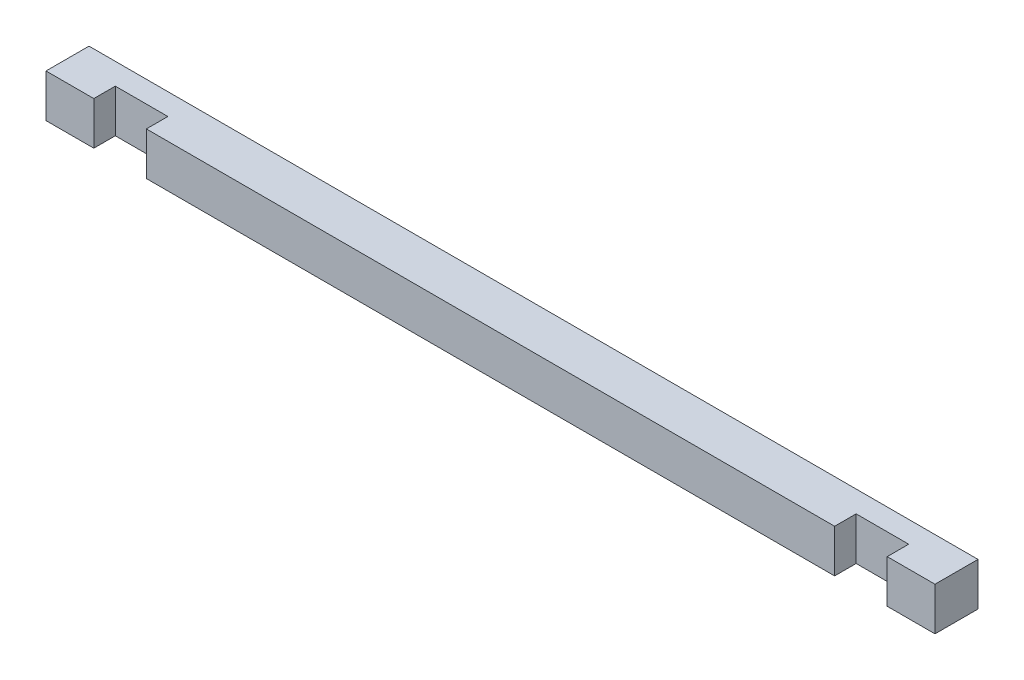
ISO-10303-21;
HEADER;
FILE_DESCRIPTION(('STEP AP214'),'2;1');
FILE_NAME('part.step','',(''),(''),'','','');
FILE_SCHEMA(('AUTOMOTIVE_DESIGN { 1 0 10303 214 1 1 1 1 }'));
ENDSEC;
DATA;
#1=APPLICATION_CONTEXT('core data for automotive mechanical design processes');
#2=APPLICATION_PROTOCOL_DEFINITION('international standard','automotive_design',2000,#1);
#3=PRODUCT_CONTEXT('',#1,'mechanical');
#4=PRODUCT('Part','Part','',(#3));
#5=PRODUCT_RELATED_PRODUCT_CATEGORY('part','',(#4));
#6=PRODUCT_DEFINITION_FORMATION('','',#4);
#7=PRODUCT_DEFINITION_CONTEXT('part definition',#1,'design');
#8=PRODUCT_DEFINITION('design','',#6,#7);
#9=PRODUCT_DEFINITION_SHAPE('','',#8);
#10=(LENGTH_UNIT() NAMED_UNIT(*) SI_UNIT(.MILLI.,.METRE.));
#11=(NAMED_UNIT(*) PLANE_ANGLE_UNIT() SI_UNIT($,.RADIAN.));
#12=(NAMED_UNIT(*) SI_UNIT($,.STERADIAN.) SOLID_ANGLE_UNIT());
#13=UNCERTAINTY_MEASURE_WITH_UNIT(LENGTH_MEASURE(1.E-05),#10,'distance_accuracy_value','');
#14=(GEOMETRIC_REPRESENTATION_CONTEXT(3) GLOBAL_UNCERTAINTY_ASSIGNED_CONTEXT((#13)) GLOBAL_UNIT_ASSIGNED_CONTEXT((#10,
#11,#12)) REPRESENTATION_CONTEXT('',''));
#15=CARTESIAN_POINT('',(0.,0.,0.));
#16=DIRECTION('',(0.,0.,1.));
#17=DIRECTION('',(1.,0.,0.));
#18=AXIS2_PLACEMENT_3D('',#15,#16,#17);
#19=CARTESIAN_POINT('',(0.,9.,9.));
#20=DIRECTION('',(0.,0.,-1.));
#21=DIRECTION('',(-1.,0.,0.));
#22=AXIS2_PLACEMENT_3D('',#19,#20,#21);
#23=PLANE('',#22);
#24=DIRECTION('',(1.,0.,0.));
#25=VECTOR('',#24,1.);
#26=CARTESIAN_POINT('',(0.,0.,9.));
#27=LINE('',#26,#25);
#28=CARTESIAN_POINT('',(0.,0.,9.));
#29=VERTEX_POINT('',#28);
#30=CARTESIAN_POINT('',(10.,0.,9.));
#31=VERTEX_POINT('',#30);
#32=EDGE_CURVE('E185',#29,#31,#27,.T.);
#33=ORIENTED_EDGE('',*,*,#32,.T.);
#34=DIRECTION('',(0.,-1.,0.));
#35=VECTOR('',#34,1.);
#36=CARTESIAN_POINT('',(10.,0.,9.));
#37=LINE('',#36,#35);
#38=CARTESIAN_POINT('',(10.,9.,9.));
#39=VERTEX_POINT('',#38);
#40=EDGE_CURVE('E125',#39,#31,#37,.T.);
#41=ORIENTED_EDGE('',*,*,#40,.F.);
#42=DIRECTION('',(-1.,0.,0.));
#43=VECTOR('',#42,1.);
#44=CARTESIAN_POINT('',(0.,9.,9.));
#45=LINE('',#44,#43);
#46=CARTESIAN_POINT('',(0.,9.,9.));
#47=VERTEX_POINT('',#46);
#48=EDGE_CURVE('E190',#39,#47,#45,.T.);
#49=ORIENTED_EDGE('',*,*,#48,.T.);
#50=DIRECTION('',(0.,-1.,0.));
#51=VECTOR('',#50,1.);
#52=CARTESIAN_POINT('',(0.,0.,9.));
#53=LINE('',#52,#51);
#54=EDGE_CURVE('E180',#47,#29,#53,.T.);
#55=ORIENTED_EDGE('',*,*,#54,.T.);
#56=EDGE_LOOP('',(#33,#41,#49,#55));
#57=FACE_BOUND('',#56,.T.);
#58=ADVANCED_FACE('F31',(#57),#23,.F.);
#59=CARTESIAN_POINT('',(165.,9.,9.));
#60=VERTEX_POINT('',#59);
#61=CARTESIAN_POINT('',(21.,9.,9.));
#62=VERTEX_POINT('',#61);
#63=EDGE_CURVE('E195',#60,#62,#45,.T.);
#64=ORIENTED_EDGE('',*,*,#63,.T.);
#65=DIRECTION('',(0.,1.,0.));
#66=VECTOR('',#65,1.);
#67=CARTESIAN_POINT('',(21.,0.,9.));
#68=LINE('',#67,#66);
#69=CARTESIAN_POINT('',(21.,0.,9.));
#70=VERTEX_POINT('',#69);
#71=EDGE_CURVE('E137',#70,#62,#68,.T.);
#72=ORIENTED_EDGE('',*,*,#71,.F.);
#73=CARTESIAN_POINT('',(165.,0.,9.));
#74=VERTEX_POINT('',#73);
#75=EDGE_CURVE('E188',#70,#74,#27,.T.);
#76=ORIENTED_EDGE('',*,*,#75,.T.);
#77=DIRECTION('',(0.,-1.,0.));
#78=VECTOR('',#77,1.);
#79=CARTESIAN_POINT('',(165.,0.,9.));
#80=LINE('',#79,#78);
#81=EDGE_CURVE('E149',#60,#74,#80,.T.);
#82=ORIENTED_EDGE('',*,*,#81,.F.);
#83=EDGE_LOOP('',(#64,#72,#76,#82));
#84=FACE_BOUND('',#83,.T.);
#85=ADVANCED_FACE('F233',(#84),#23,.F.);
#86=CARTESIAN_POINT('',(0.,0.,9.));
#87=DIRECTION('',(1.,0.,0.));
#88=DIRECTION('',(0.,0.,-1.));
#89=AXIS2_PLACEMENT_3D('',#86,#87,#88);
#90=PLANE('',#89);
#91=DIRECTION('',(0.,-1.,0.));
#92=VECTOR('',#91,1.);
#93=CARTESIAN_POINT('',(0.,0.,0.));
#94=LINE('',#93,#92);
#95=CARTESIAN_POINT('',(0.,9.,0.));
#96=VERTEX_POINT('',#95);
#97=CARTESIAN_POINT('',(0.,0.,0.));
#98=VERTEX_POINT('',#97);
#99=EDGE_CURVE('E173',#96,#98,#94,.T.);
#100=ORIENTED_EDGE('',*,*,#99,.T.);
#101=DIRECTION('',(0.,0.,-1.));
#102=VECTOR('',#101,1.);
#103=CARTESIAN_POINT('',(0.,0.,9.));
#104=LINE('',#103,#102);
#105=EDGE_CURVE('E11',#29,#98,#104,.T.);
#106=ORIENTED_EDGE('',*,*,#105,.F.);
#107=ORIENTED_EDGE('',*,*,#54,.F.);
#108=DIRECTION('',(0.,0.,-1.));
#109=VECTOR('',#108,1.);
#110=CARTESIAN_POINT('',(0.,9.,9.));
#111=LINE('',#110,#109);
#112=EDGE_CURVE('E194',#47,#96,#111,.T.);
#113=ORIENTED_EDGE('',*,*,#112,.T.);
#114=EDGE_LOOP('',(#100,#106,#107,#113));
#115=FACE_BOUND('',#114,.T.);
#116=ADVANCED_FACE('F33',(#115),#90,.F.);
#117=CARTESIAN_POINT('',(0.,0.,9.));
#118=DIRECTION('',(0.,1.,0.));
#119=DIRECTION('',(0.,0.,1.));
#120=AXIS2_PLACEMENT_3D('',#117,#118,#119);
#121=PLANE('',#120);
#122=DIRECTION('',(1.,0.,0.));
#123=VECTOR('',#122,1.);
#124=CARTESIAN_POINT('',(10.,0.,4.5));
#125=LINE('',#124,#123);
#126=CARTESIAN_POINT('',(10.,0.,4.5));
#127=VERTEX_POINT('',#126);
#128=CARTESIAN_POINT('',(21.,0.,4.5));
#129=VERTEX_POINT('',#128);
#130=EDGE_CURVE('E133',#127,#129,#125,.T.);
#131=ORIENTED_EDGE('',*,*,#130,.F.);
#132=DIRECTION('',(0.,0.,1.));
#133=VECTOR('',#132,1.);
#134=CARTESIAN_POINT('',(10.,0.,4.5));
#135=LINE('',#134,#133);
#136=EDGE_CURVE('E120',#127,#31,#135,.T.);
#137=ORIENTED_EDGE('',*,*,#136,.T.);
#138=ORIENTED_EDGE('',*,*,#32,.F.);
#139=ORIENTED_EDGE('',*,*,#105,.T.);
#140=DIRECTION('',(1.,0.,0.));
#141=VECTOR('',#140,1.);
#142=CARTESIAN_POINT('',(0.,0.,0.));
#143=LINE('',#142,#141);
#144=CARTESIAN_POINT('',(186.,0.,0.));
#145=VERTEX_POINT('',#144);
#146=EDGE_CURVE('E198',#98,#145,#143,.T.);
#147=ORIENTED_EDGE('',*,*,#146,.T.);
#148=DIRECTION('',(0.,0.,-1.));
#149=VECTOR('',#148,1.);
#150=CARTESIAN_POINT('',(186.,0.,9.));
#151=LINE('',#150,#149);
#152=CARTESIAN_POINT('',(186.,0.,9.));
#153=VERTEX_POINT('',#152);
#154=EDGE_CURVE('E39',#153,#145,#151,.T.);
#155=ORIENTED_EDGE('',*,*,#154,.F.);
#156=CARTESIAN_POINT('',(176.,0.,9.));
#157=VERTEX_POINT('',#156);
#158=EDGE_CURVE('E183',#157,#153,#27,.T.);
#159=ORIENTED_EDGE('',*,*,#158,.F.);
#160=DIRECTION('',(0.,0.,1.));
#161=VECTOR('',#160,1.);
#162=CARTESIAN_POINT('',(176.,0.,4.5));
#163=LINE('',#162,#161);
#164=CARTESIAN_POINT('',(176.,0.,4.5));
#165=VERTEX_POINT('',#164);
#166=EDGE_CURVE('E54',#165,#157,#163,.T.);
#167=ORIENTED_EDGE('',*,*,#166,.F.);
#168=DIRECTION('',(1.,0.,0.));
#169=VECTOR('',#168,1.);
#170=CARTESIAN_POINT('',(165.,0.,4.5));
#171=LINE('',#170,#169);
#172=CARTESIAN_POINT('',(165.,0.,4.5));
#173=VERTEX_POINT('',#172);
#174=EDGE_CURVE('E157',#173,#165,#171,.T.);
#175=ORIENTED_EDGE('',*,*,#174,.F.);
#176=DIRECTION('',(0.,0.,1.));
#177=VECTOR('',#176,1.);
#178=CARTESIAN_POINT('',(165.,0.,4.5));
#179=LINE('',#178,#177);
#180=EDGE_CURVE('E167',#173,#74,#179,.T.);
#181=ORIENTED_EDGE('',*,*,#180,.T.);
#182=ORIENTED_EDGE('',*,*,#75,.F.);
#183=DIRECTION('',(0.,0.,1.));
#184=VECTOR('',#183,1.);
#185=CARTESIAN_POINT('',(21.,0.,4.5));
#186=LINE('',#185,#184);
#187=EDGE_CURVE('E129',#129,#70,#186,.T.);
#188=ORIENTED_EDGE('',*,*,#187,.F.);
#189=EDGE_LOOP('',(#131,#137,#138,#139,#147,#155,#159,#167,#175,#181,#182,#188));
#190=FACE_BOUND('',#189,.T.);
#191=ADVANCED_FACE('F139',(#190),#121,.F.);
#192=CARTESIAN_POINT('',(186.,0.,9.));
#193=DIRECTION('',(-1.,0.,0.));
#194=DIRECTION('',(0.,0.,1.));
#195=AXIS2_PLACEMENT_3D('',#192,#193,#194);
#196=PLANE('',#195);
#197=DIRECTION('',(0.,1.,0.));
#198=VECTOR('',#197,1.);
#199=CARTESIAN_POINT('',(186.,0.,0.));
#200=LINE('',#199,#198);
#201=CARTESIAN_POINT('',(186.,9.,0.));
#202=VERTEX_POINT('',#201);
#203=EDGE_CURVE('E200',#145,#202,#200,.T.);
#204=ORIENTED_EDGE('',*,*,#203,.T.);
#205=DIRECTION('',(0.,0.,-1.));
#206=VECTOR('',#205,1.);
#207=CARTESIAN_POINT('',(186.,9.,9.));
#208=LINE('',#207,#206);
#209=CARTESIAN_POINT('',(186.,9.,9.));
#210=VERTEX_POINT('',#209);
#211=EDGE_CURVE('E205',#210,#202,#208,.T.);
#212=ORIENTED_EDGE('',*,*,#211,.F.);
#213=DIRECTION('',(0.,1.,0.));
#214=VECTOR('',#213,1.);
#215=CARTESIAN_POINT('',(186.,0.,9.));
#216=LINE('',#215,#214);
#217=EDGE_CURVE('E187',#153,#210,#216,.T.);
#218=ORIENTED_EDGE('',*,*,#217,.F.);
#219=ORIENTED_EDGE('',*,*,#154,.T.);
#220=EDGE_LOOP('',(#204,#212,#218,#219));
#221=FACE_BOUND('',#220,.T.);
#222=ADVANCED_FACE('F212',(#221),#196,.F.);
#223=CARTESIAN_POINT('',(0.,9.,9.));
#224=DIRECTION('',(0.,-1.,0.));
#225=DIRECTION('',(0.,0.,-1.));
#226=AXIS2_PLACEMENT_3D('',#223,#224,#225);
#227=PLANE('',#226);
#228=ORIENTED_EDGE('',*,*,#48,.F.);
#229=DIRECTION('',(0.,0.,1.));
#230=VECTOR('',#229,1.);
#231=CARTESIAN_POINT('',(10.,9.,4.5));
#232=LINE('',#231,#230);
#233=CARTESIAN_POINT('',(10.,9.,4.5));
#234=VERTEX_POINT('',#233);
#235=EDGE_CURVE('E147',#234,#39,#232,.T.);
#236=ORIENTED_EDGE('',*,*,#235,.F.);
#237=DIRECTION('',(-1.,0.,0.));
#238=VECTOR('',#237,1.);
#239=CARTESIAN_POINT('',(10.,9.,4.5));
#240=LINE('',#239,#238);
#241=CARTESIAN_POINT('',(21.,9.,4.5));
#242=VERTEX_POINT('',#241);
#243=EDGE_CURVE('E130',#242,#234,#240,.T.);
#244=ORIENTED_EDGE('',*,*,#243,.F.);
#245=DIRECTION('',(0.,0.,1.));
#246=VECTOR('',#245,1.);
#247=CARTESIAN_POINT('',(21.,9.,4.5));
#248=LINE('',#247,#246);
#249=EDGE_CURVE('E150',#242,#62,#248,.T.);
#250=ORIENTED_EDGE('',*,*,#249,.T.);
#251=ORIENTED_EDGE('',*,*,#63,.F.);
#252=DIRECTION('',(0.,0.,1.));
#253=VECTOR('',#252,1.);
#254=CARTESIAN_POINT('',(165.,9.,4.5));
#255=LINE('',#254,#253);
#256=CARTESIAN_POINT('',(165.,9.,4.5));
#257=VERTEX_POINT('',#256);
#258=EDGE_CURVE('E171',#257,#60,#255,.T.);
#259=ORIENTED_EDGE('',*,*,#258,.F.);
#260=DIRECTION('',(-1.,0.,0.));
#261=VECTOR('',#260,1.);
#262=CARTESIAN_POINT('',(165.,9.,4.5));
#263=LINE('',#262,#261);
#264=CARTESIAN_POINT('',(176.,9.,4.5));
#265=VERTEX_POINT('',#264);
#266=EDGE_CURVE('E164',#265,#257,#263,.T.);
#267=ORIENTED_EDGE('',*,*,#266,.F.);
#268=DIRECTION('',(0.,0.,1.));
#269=VECTOR('',#268,1.);
#270=CARTESIAN_POINT('',(176.,9.,4.5));
#271=LINE('',#270,#269);
#272=CARTESIAN_POINT('',(176.,9.,9.));
#273=VERTEX_POINT('',#272);
#274=EDGE_CURVE('E174',#265,#273,#271,.T.);
#275=ORIENTED_EDGE('',*,*,#274,.T.);
#276=EDGE_CURVE('E191',#210,#273,#45,.T.);
#277=ORIENTED_EDGE('',*,*,#276,.F.);
#278=ORIENTED_EDGE('',*,*,#211,.T.);
#279=DIRECTION('',(-1.,0.,0.));
#280=VECTOR('',#279,1.);
#281=CARTESIAN_POINT('',(0.,9.,0.));
#282=LINE('',#281,#280);
#283=EDGE_CURVE('E184',#202,#96,#282,.T.);
#284=ORIENTED_EDGE('',*,*,#283,.T.);
#285=ORIENTED_EDGE('',*,*,#112,.F.);
#286=EDGE_LOOP('',(#228,#236,#244,#250,#251,#259,#267,#275,#277,#278,#284,#285));
#287=FACE_BOUND('',#286,.T.);
#288=ADVANCED_FACE('F222',(#287),#227,.F.);
#289=ORIENTED_EDGE('',*,*,#276,.T.);
#290=DIRECTION('',(0.,1.,0.));
#291=VECTOR('',#290,1.);
#292=CARTESIAN_POINT('',(176.,0.,9.));
#293=LINE('',#292,#291);
#294=EDGE_CURVE('E158',#157,#273,#293,.T.);
#295=ORIENTED_EDGE('',*,*,#294,.F.);
#296=ORIENTED_EDGE('',*,*,#158,.T.);
#297=ORIENTED_EDGE('',*,*,#217,.T.);
#298=EDGE_LOOP('',(#289,#295,#296,#297));
#299=FACE_BOUND('',#298,.T.);
#300=ADVANCED_FACE('F249',(#299),#23,.F.);
#301=CARTESIAN_POINT('',(0.,9.,0.));
#302=DIRECTION('',(0.,0.,-1.));
#303=DIRECTION('',(-1.,0.,0.));
#304=AXIS2_PLACEMENT_3D('',#301,#302,#303);
#305=PLANE('',#304);
#306=ORIENTED_EDGE('',*,*,#99,.F.);
#307=ORIENTED_EDGE('',*,*,#283,.F.);
#308=ORIENTED_EDGE('',*,*,#203,.F.);
#309=ORIENTED_EDGE('',*,*,#146,.F.);
#310=EDGE_LOOP('',(#306,#307,#308,#309));
#311=FACE_BOUND('',#310,.T.);
#312=ADVANCED_FACE('F218',(#311),#305,.T.);
#313=CARTESIAN_POINT('',(165.,0.,4.5));
#314=DIRECTION('',(-1.,0.,0.));
#315=DIRECTION('',(0.,0.,1.));
#316=AXIS2_PLACEMENT_3D('',#313,#314,#315);
#317=PLANE('',#316);
#318=ORIENTED_EDGE('',*,*,#81,.T.);
#319=ORIENTED_EDGE('',*,*,#180,.F.);
#320=DIRECTION('',(0.,-1.,0.));
#321=VECTOR('',#320,1.);
#322=CARTESIAN_POINT('',(165.,0.,4.5));
#323=LINE('',#322,#321);
#324=EDGE_CURVE('E154',#257,#173,#323,.T.);
#325=ORIENTED_EDGE('',*,*,#324,.F.);
#326=ORIENTED_EDGE('',*,*,#258,.T.);
#327=EDGE_LOOP('',(#318,#319,#325,#326));
#328=FACE_BOUND('',#327,.T.);
#329=ADVANCED_FACE('F261',(#328),#317,.F.);
#330=CARTESIAN_POINT('',(176.,0.,4.5));
#331=DIRECTION('',(1.,0.,0.));
#332=DIRECTION('',(0.,0.,-1.));
#333=AXIS2_PLACEMENT_3D('',#330,#331,#332);
#334=PLANE('',#333);
#335=ORIENTED_EDGE('',*,*,#294,.T.);
#336=ORIENTED_EDGE('',*,*,#274,.F.);
#337=DIRECTION('',(0.,1.,0.));
#338=VECTOR('',#337,1.);
#339=CARTESIAN_POINT('',(176.,0.,4.5));
#340=LINE('',#339,#338);
#341=EDGE_CURVE('E161',#165,#265,#340,.T.);
#342=ORIENTED_EDGE('',*,*,#341,.F.);
#343=ORIENTED_EDGE('',*,*,#166,.T.);
#344=EDGE_LOOP('',(#335,#336,#342,#343));
#345=FACE_BOUND('',#344,.T.);
#346=ADVANCED_FACE('F263',(#345),#334,.F.);
#347=CARTESIAN_POINT('',(165.,9.,4.5));
#348=DIRECTION('',(0.,0.,-1.));
#349=DIRECTION('',(-1.,0.,0.));
#350=AXIS2_PLACEMENT_3D('',#347,#348,#349);
#351=PLANE('',#350);
#352=ORIENTED_EDGE('',*,*,#324,.T.);
#353=ORIENTED_EDGE('',*,*,#174,.T.);
#354=ORIENTED_EDGE('',*,*,#341,.T.);
#355=ORIENTED_EDGE('',*,*,#266,.T.);
#356=EDGE_LOOP('',(#352,#353,#354,#355));
#357=FACE_BOUND('',#356,.T.);
#358=ADVANCED_FACE('F245',(#357),#351,.F.);
#359=CARTESIAN_POINT('',(10.,0.,4.5));
#360=DIRECTION('',(-1.,0.,0.));
#361=DIRECTION('',(0.,0.,1.));
#362=AXIS2_PLACEMENT_3D('',#359,#360,#361);
#363=PLANE('',#362);
#364=ORIENTED_EDGE('',*,*,#40,.T.);
#365=ORIENTED_EDGE('',*,*,#136,.F.);
#366=DIRECTION('',(0.,-1.,0.));
#367=VECTOR('',#366,1.);
#368=CARTESIAN_POINT('',(10.,0.,4.5));
#369=LINE('',#368,#367);
#370=EDGE_CURVE('E123',#234,#127,#369,.T.);
#371=ORIENTED_EDGE('',*,*,#370,.F.);
#372=ORIENTED_EDGE('',*,*,#235,.T.);
#373=EDGE_LOOP('',(#364,#365,#371,#372));
#374=FACE_BOUND('',#373,.T.);
#375=ADVANCED_FACE('F122',(#374),#363,.F.);
#376=CARTESIAN_POINT('',(21.,0.,4.5));
#377=DIRECTION('',(1.,0.,0.));
#378=DIRECTION('',(0.,0.,-1.));
#379=AXIS2_PLACEMENT_3D('',#376,#377,#378);
#380=PLANE('',#379);
#381=ORIENTED_EDGE('',*,*,#71,.T.);
#382=ORIENTED_EDGE('',*,*,#249,.F.);
#383=DIRECTION('',(0.,1.,0.));
#384=VECTOR('',#383,1.);
#385=CARTESIAN_POINT('',(21.,0.,4.5));
#386=LINE('',#385,#384);
#387=EDGE_CURVE('E46',#129,#242,#386,.T.);
#388=ORIENTED_EDGE('',*,*,#387,.F.);
#389=ORIENTED_EDGE('',*,*,#187,.T.);
#390=EDGE_LOOP('',(#381,#382,#388,#389));
#391=FACE_BOUND('',#390,.T.);
#392=ADVANCED_FACE('F237',(#391),#380,.F.);
#393=CARTESIAN_POINT('',(10.,9.,4.5));
#394=DIRECTION('',(0.,0.,-1.));
#395=DIRECTION('',(-1.,0.,0.));
#396=AXIS2_PLACEMENT_3D('',#393,#394,#395);
#397=PLANE('',#396);
#398=ORIENTED_EDGE('',*,*,#370,.T.);
#399=ORIENTED_EDGE('',*,*,#130,.T.);
#400=ORIENTED_EDGE('',*,*,#387,.T.);
#401=ORIENTED_EDGE('',*,*,#243,.T.);
#402=EDGE_LOOP('',(#398,#399,#400,#401));
#403=FACE_BOUND('',#402,.T.);
#404=ADVANCED_FACE('F132',(#403),#397,.F.);
#405=CLOSED_SHELL('',(#58,#85,#116,#191,#222,#288,#300,#312,#329,#346,#358,#375,#392,#404));
#406=MANIFOLD_SOLID_BREP('B2',#405);
#407=ADVANCED_BREP_SHAPE_REPRESENTATION('',(#18,#406),#14);
#408=SHAPE_DEFINITION_REPRESENTATION(#9,#407);
ENDSEC;
END-ISO-10303-21;
